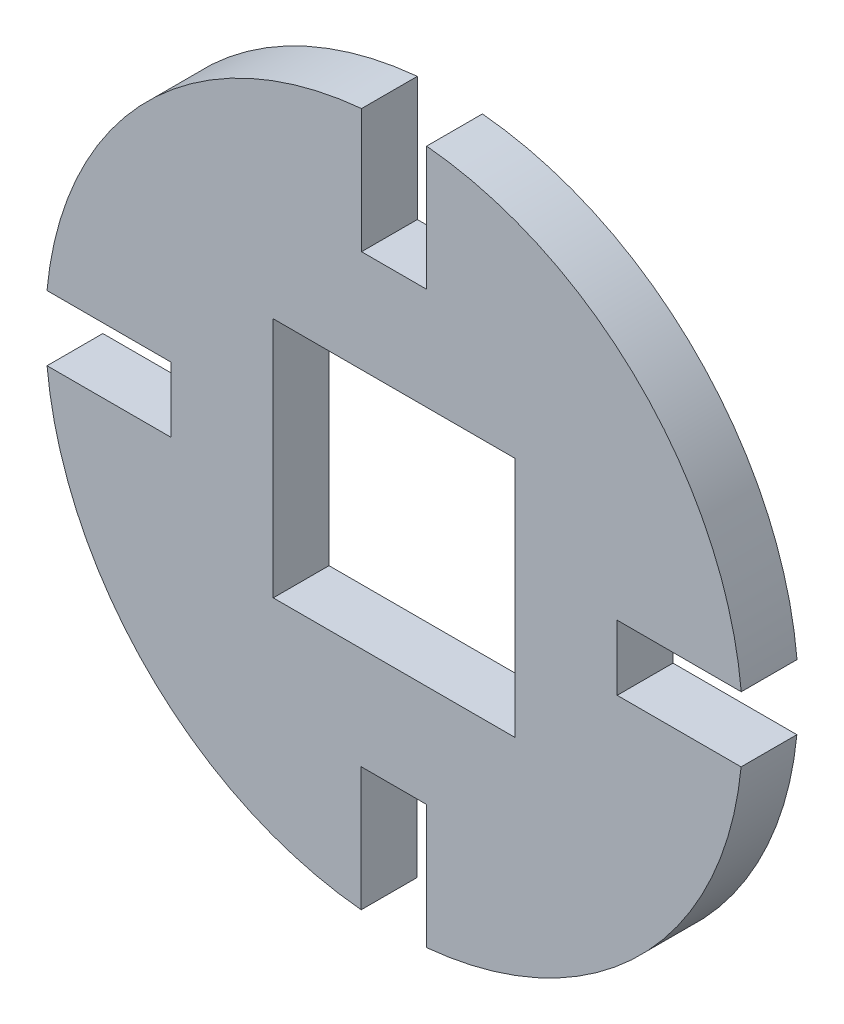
ISO-10303-21;
HEADER;
FILE_DESCRIPTION(('STEP AP214'),'2;1');
FILE_NAME('part.step','',(''),(''),'','','');
FILE_SCHEMA(('AUTOMOTIVE_DESIGN { 1 0 10303 214 1 1 1 1 }'));
ENDSEC;
DATA;
#1=APPLICATION_CONTEXT('core data for automotive mechanical design processes');
#2=APPLICATION_PROTOCOL_DEFINITION('international standard','automotive_design',2000,#1);
#3=PRODUCT_CONTEXT('',#1,'mechanical');
#4=PRODUCT('Part','Part','',(#3));
#5=PRODUCT_RELATED_PRODUCT_CATEGORY('part','',(#4));
#6=PRODUCT_DEFINITION_FORMATION('','',#4);
#7=PRODUCT_DEFINITION_CONTEXT('part definition',#1,'design');
#8=PRODUCT_DEFINITION('design','',#6,#7);
#9=PRODUCT_DEFINITION_SHAPE('','',#8);
#10=(LENGTH_UNIT() NAMED_UNIT(*) SI_UNIT(.MILLI.,.METRE.));
#11=(NAMED_UNIT(*) PLANE_ANGLE_UNIT() SI_UNIT($,.RADIAN.));
#12=(NAMED_UNIT(*) SI_UNIT($,.STERADIAN.) SOLID_ANGLE_UNIT());
#13=UNCERTAINTY_MEASURE_WITH_UNIT(LENGTH_MEASURE(1.E-05),#10,'distance_accuracy_value','');
#14=(GEOMETRIC_REPRESENTATION_CONTEXT(3) GLOBAL_UNCERTAINTY_ASSIGNED_CONTEXT((#13)) GLOBAL_UNIT_ASSIGNED_CONTEXT((#10,
#11,#12)) REPRESENTATION_CONTEXT('',''));
#15=CARTESIAN_POINT('',(0.,0.,0.));
#16=DIRECTION('',(0.,0.,1.));
#17=DIRECTION('',(1.,0.,0.));
#18=AXIS2_PLACEMENT_3D('',#15,#16,#17);
#19=CARTESIAN_POINT('',(0.,0.,3.));
#20=DIRECTION('',(0.,0.,1.));
#21=DIRECTION('',(1.,0.,0.));
#22=AXIS2_PLACEMENT_3D('',#19,#20,#21);
#23=PLANE('',#22);
#24=CARTESIAN_POINT('',(0.,0.,3.));
#25=DIRECTION('',(0.,0.,1.));
#26=DIRECTION('',(1.,0.,0.));
#27=AXIS2_PLACEMENT_3D('',#24,#25,#26);
#28=CIRCLE('',#27,18.75);
#29=CARTESIAN_POINT('',(1.73020230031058,-18.67,3.));
#30=VERTEX_POINT('',#29);
#31=CARTESIAN_POINT('',(18.6643739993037,-1.78987240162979,3.));
#32=VERTEX_POINT('',#31);
#33=EDGE_CURVE('E229',#30,#32,#28,.T.);
#34=ORIENTED_EDGE('',*,*,#33,.T.);
#35=DIRECTION('',(-1.,0.,0.));
#36=VECTOR('',#35,1.);
#37=CARTESIAN_POINT('',(12.,-1.78987240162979,3.));
#38=LINE('',#37,#36);
#39=CARTESIAN_POINT('',(12.,-1.78987240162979,3.));
#40=VERTEX_POINT('',#39);
#41=EDGE_CURVE('E233',#32,#40,#38,.T.);
#42=ORIENTED_EDGE('',*,*,#41,.T.);
#43=DIRECTION('',(0.,1.,0.));
#44=VECTOR('',#43,1.);
#45=CARTESIAN_POINT('',(12.,-1.78987240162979,3.));
#46=LINE('',#45,#44);
#47=CARTESIAN_POINT('',(12.,1.71012759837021,3.));
#48=VERTEX_POINT('',#47);
#49=EDGE_CURVE('E237',#40,#48,#46,.T.);
#50=ORIENTED_EDGE('',*,*,#49,.T.);
#51=DIRECTION('',(1.,0.,0.));
#52=VECTOR('',#51,1.);
#53=CARTESIAN_POINT('',(12.,1.71012759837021,3.));
#54=LINE('',#53,#52);
#55=CARTESIAN_POINT('',(18.6718494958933,1.71012759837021,3.));
#56=VERTEX_POINT('',#55);
#57=EDGE_CURVE('E240',#48,#56,#54,.T.);
#58=ORIENTED_EDGE('',*,*,#57,.T.);
#59=CARTESIAN_POINT('',(0.,0.,3.));
#60=DIRECTION('',(0.,0.,1.));
#61=DIRECTION('',(1.,0.,0.));
#62=AXIS2_PLACEMENT_3D('',#59,#60,#61);
#63=CIRCLE('',#62,18.75);
#64=CARTESIAN_POINT('',(1.75,18.6681547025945,3.));
#65=VERTEX_POINT('',#64);
#66=EDGE_CURVE('E243',#56,#65,#63,.T.);
#67=ORIENTED_EDGE('',*,*,#66,.T.);
#68=DIRECTION('',(0.,-1.,0.));
#69=VECTOR('',#68,1.);
#70=CARTESIAN_POINT('',(1.75,11.9981547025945,3.));
#71=LINE('',#70,#69);
#72=CARTESIAN_POINT('',(1.75,11.9981547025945,3.));
#73=VERTEX_POINT('',#72);
#74=EDGE_CURVE('E246',#65,#73,#71,.T.);
#75=ORIENTED_EDGE('',*,*,#74,.T.);
#76=DIRECTION('',(-1.,0.,0.));
#77=VECTOR('',#76,1.);
#78=CARTESIAN_POINT('',(-1.75,11.9981547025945,3.));
#79=LINE('',#78,#77);
#80=CARTESIAN_POINT('',(-1.75,11.9981547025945,3.));
#81=VERTEX_POINT('',#80);
#82=EDGE_CURVE('E249',#73,#81,#79,.T.);
#83=ORIENTED_EDGE('',*,*,#82,.T.);
#84=DIRECTION('',(0.,1.,0.));
#85=VECTOR('',#84,1.);
#86=CARTESIAN_POINT('',(-1.75,11.9981547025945,3.));
#87=LINE('',#86,#85);
#88=CARTESIAN_POINT('',(-1.75,18.6681547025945,3.));
#89=VERTEX_POINT('',#88);
#90=EDGE_CURVE('E252',#81,#89,#87,.T.);
#91=ORIENTED_EDGE('',*,*,#90,.T.);
#92=CARTESIAN_POINT('',(0.,0.,3.));
#93=DIRECTION('',(0.,0.,1.));
#94=DIRECTION('',(1.,0.,0.));
#95=AXIS2_PLACEMENT_3D('',#92,#93,#94);
#96=CIRCLE('',#95,18.75);
#97=CARTESIAN_POINT('',(-18.67,1.73020230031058,3.));
#98=VERTEX_POINT('',#97);
#99=EDGE_CURVE('E255',#89,#98,#96,.T.);
#100=ORIENTED_EDGE('',*,*,#99,.T.);
#101=DIRECTION('',(1.,0.,0.));
#102=VECTOR('',#101,1.);
#103=CARTESIAN_POINT('',(-12.,1.73020230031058,3.));
#104=LINE('',#103,#102);
#105=CARTESIAN_POINT('',(-12.,1.73020230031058,3.));
#106=VERTEX_POINT('',#105);
#107=EDGE_CURVE('E258',#98,#106,#104,.T.);
#108=ORIENTED_EDGE('',*,*,#107,.T.);
#109=DIRECTION('',(0.,-1.,0.));
#110=VECTOR('',#109,1.);
#111=CARTESIAN_POINT('',(-12.,-1.76979769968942,3.));
#112=LINE('',#111,#110);
#113=CARTESIAN_POINT('',(-12.,-1.76979769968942,3.));
#114=VERTEX_POINT('',#113);
#115=EDGE_CURVE('E261',#106,#114,#112,.T.);
#116=ORIENTED_EDGE('',*,*,#115,.T.);
#117=DIRECTION('',(-1.,0.,0.));
#118=VECTOR('',#117,1.);
#119=CARTESIAN_POINT('',(-12.,-1.76979769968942,3.));
#120=LINE('',#119,#118);
#121=CARTESIAN_POINT('',(-18.6662882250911,-1.76979769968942,3.));
#122=VERTEX_POINT('',#121);
#123=EDGE_CURVE('E264',#114,#122,#120,.T.);
#124=ORIENTED_EDGE('',*,*,#123,.T.);
#125=CARTESIAN_POINT('',(0.,0.,3.));
#126=DIRECTION('',(0.,0.,1.));
#127=DIRECTION('',(1.,0.,0.));
#128=AXIS2_PLACEMENT_3D('',#125,#126,#127);
#129=CIRCLE('',#128,18.75);
#130=CARTESIAN_POINT('',(-1.76979769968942,-18.6662882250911,3.));
#131=VERTEX_POINT('',#130);
#132=EDGE_CURVE('E267',#122,#131,#129,.T.);
#133=ORIENTED_EDGE('',*,*,#132,.T.);
#134=DIRECTION('',(0.,1.,0.));
#135=VECTOR('',#134,1.);
#136=CARTESIAN_POINT('',(-1.76979769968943,-12.,3.));
#137=LINE('',#136,#135);
#138=CARTESIAN_POINT('',(-1.76979769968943,-12.,3.));
#139=VERTEX_POINT('',#138);
#140=EDGE_CURVE('E270',#131,#139,#137,.T.);
#141=ORIENTED_EDGE('',*,*,#140,.T.);
#142=DIRECTION('',(1.,0.,0.));
#143=VECTOR('',#142,1.);
#144=CARTESIAN_POINT('',(-1.76979769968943,-12.,3.));
#145=LINE('',#144,#143);
#146=CARTESIAN_POINT('',(1.73020230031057,-12.,3.));
#147=VERTEX_POINT('',#146);
#148=EDGE_CURVE('E273',#139,#147,#145,.T.);
#149=ORIENTED_EDGE('',*,*,#148,.T.);
#150=DIRECTION('',(0.,-1.,0.));
#151=VECTOR('',#150,1.);
#152=CARTESIAN_POINT('',(1.73020230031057,-12.,3.));
#153=LINE('',#152,#151);
#154=EDGE_CURVE('E276',#147,#30,#153,.T.);
#155=ORIENTED_EDGE('',*,*,#154,.T.);
#156=EDGE_LOOP('',(#34,#42,#50,#58,#67,#75,#83,#91,#100,#108,#116,#124,#133,#141,#149,#155));
#157=FACE_BOUND('',#156,.T.);
#158=DIRECTION('',(-1.,0.,0.));
#159=VECTOR('',#158,1.);
#160=CARTESIAN_POINT('',(-6.5,6.5,3.));
#161=LINE('',#160,#159);
#162=CARTESIAN_POINT('',(6.5,6.5,3.));
#163=VERTEX_POINT('',#162);
#164=CARTESIAN_POINT('',(-6.5,6.5,3.));
#165=VERTEX_POINT('',#164);
#166=EDGE_CURVE('E190',#163,#165,#161,.T.);
#167=ORIENTED_EDGE('',*,*,#166,.F.);
#168=DIRECTION('',(0.,1.,0.));
#169=VECTOR('',#168,1.);
#170=CARTESIAN_POINT('',(6.5,-6.5,3.));
#171=LINE('',#170,#169);
#172=CARTESIAN_POINT('',(6.5,-6.5,3.));
#173=VERTEX_POINT('',#172);
#174=EDGE_CURVE('E181',#173,#163,#171,.T.);
#175=ORIENTED_EDGE('',*,*,#174,.F.);
#176=DIRECTION('',(1.,0.,0.));
#177=VECTOR('',#176,1.);
#178=CARTESIAN_POINT('',(-6.5,-6.5,3.));
#179=LINE('',#178,#177);
#180=CARTESIAN_POINT('',(-6.5,-6.5,3.));
#181=VERTEX_POINT('',#180);
#182=EDGE_CURVE('E207',#181,#173,#179,.T.);
#183=ORIENTED_EDGE('',*,*,#182,.F.);
#184=DIRECTION('',(0.,-1.,0.));
#185=VECTOR('',#184,1.);
#186=CARTESIAN_POINT('',(-6.5,-6.5,3.));
#187=LINE('',#186,#185);
#188=EDGE_CURVE('E203',#165,#181,#187,.T.);
#189=ORIENTED_EDGE('',*,*,#188,.F.);
#190=EDGE_LOOP('',(#167,#175,#183,#189));
#191=FACE_BOUND('',#190,.T.);
#192=ADVANCED_FACE('F43',(#157,#191),#23,.T.);
#193=CARTESIAN_POINT('',(0.,0.,0.));
#194=DIRECTION('',(0.,0.,1.));
#195=DIRECTION('',(1.,0.,0.));
#196=AXIS2_PLACEMENT_3D('',#193,#194,#195);
#197=PLANE('',#196);
#198=CARTESIAN_POINT('',(0.,0.,0.));
#199=DIRECTION('',(0.,0.,1.));
#200=DIRECTION('',(1.,0.,0.));
#201=AXIS2_PLACEMENT_3D('',#198,#199,#200);
#202=CIRCLE('',#201,18.75);
#203=CARTESIAN_POINT('',(1.73020230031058,-18.67,0.));
#204=VERTEX_POINT('',#203);
#205=CARTESIAN_POINT('',(18.6643739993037,-1.78987240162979,0.));
#206=VERTEX_POINT('',#205);
#207=EDGE_CURVE('E199',#204,#206,#202,.T.);
#208=ORIENTED_EDGE('',*,*,#207,.F.);
#209=DIRECTION('',(0.,-1.,0.));
#210=VECTOR('',#209,1.);
#211=CARTESIAN_POINT('',(1.73020230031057,-12.,0.));
#212=LINE('',#211,#210);
#213=CARTESIAN_POINT('',(1.73020230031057,-12.,0.));
#214=VERTEX_POINT('',#213);
#215=EDGE_CURVE('E234',#214,#204,#212,.T.);
#216=ORIENTED_EDGE('',*,*,#215,.F.);
#217=DIRECTION('',(1.,0.,0.));
#218=VECTOR('',#217,1.);
#219=CARTESIAN_POINT('',(-1.76979769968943,-12.,0.));
#220=LINE('',#219,#218);
#221=CARTESIAN_POINT('',(-1.76979769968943,-12.,0.));
#222=VERTEX_POINT('',#221);
#223=EDGE_CURVE('E322',#222,#214,#220,.T.);
#224=ORIENTED_EDGE('',*,*,#223,.F.);
#225=DIRECTION('',(0.,1.,0.));
#226=VECTOR('',#225,1.);
#227=CARTESIAN_POINT('',(-1.76979769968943,-12.,0.));
#228=LINE('',#227,#226);
#229=CARTESIAN_POINT('',(-1.76979769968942,-18.6662882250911,0.));
#230=VERTEX_POINT('',#229);
#231=EDGE_CURVE('E319',#230,#222,#228,.T.);
#232=ORIENTED_EDGE('',*,*,#231,.F.);
#233=CARTESIAN_POINT('',(0.,0.,0.));
#234=DIRECTION('',(0.,0.,1.));
#235=DIRECTION('',(1.,0.,0.));
#236=AXIS2_PLACEMENT_3D('',#233,#234,#235);
#237=CIRCLE('',#236,18.75);
#238=CARTESIAN_POINT('',(-18.6662882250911,-1.76979769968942,0.));
#239=VERTEX_POINT('',#238);
#240=EDGE_CURVE('E316',#239,#230,#237,.T.);
#241=ORIENTED_EDGE('',*,*,#240,.F.);
#242=DIRECTION('',(-1.,0.,0.));
#243=VECTOR('',#242,1.);
#244=CARTESIAN_POINT('',(-12.,-1.76979769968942,0.));
#245=LINE('',#244,#243);
#246=CARTESIAN_POINT('',(-12.,-1.76979769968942,0.));
#247=VERTEX_POINT('',#246);
#248=EDGE_CURVE('E313',#247,#239,#245,.T.);
#249=ORIENTED_EDGE('',*,*,#248,.F.);
#250=DIRECTION('',(0.,-1.,0.));
#251=VECTOR('',#250,1.);
#252=CARTESIAN_POINT('',(-12.,-1.76979769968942,0.));
#253=LINE('',#252,#251);
#254=CARTESIAN_POINT('',(-12.,1.73020230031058,0.));
#255=VERTEX_POINT('',#254);
#256=EDGE_CURVE('E310',#255,#247,#253,.T.);
#257=ORIENTED_EDGE('',*,*,#256,.F.);
#258=DIRECTION('',(1.,0.,0.));
#259=VECTOR('',#258,1.);
#260=CARTESIAN_POINT('',(-12.,1.73020230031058,0.));
#261=LINE('',#260,#259);
#262=CARTESIAN_POINT('',(-18.67,1.73020230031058,0.));
#263=VERTEX_POINT('',#262);
#264=EDGE_CURVE('E307',#263,#255,#261,.T.);
#265=ORIENTED_EDGE('',*,*,#264,.F.);
#266=CARTESIAN_POINT('',(0.,0.,0.));
#267=DIRECTION('',(0.,0.,1.));
#268=DIRECTION('',(1.,0.,0.));
#269=AXIS2_PLACEMENT_3D('',#266,#267,#268);
#270=CIRCLE('',#269,18.75);
#271=CARTESIAN_POINT('',(-1.75,18.6681547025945,0.));
#272=VERTEX_POINT('',#271);
#273=EDGE_CURVE('E304',#272,#263,#270,.T.);
#274=ORIENTED_EDGE('',*,*,#273,.F.);
#275=DIRECTION('',(0.,1.,0.));
#276=VECTOR('',#275,1.);
#277=CARTESIAN_POINT('',(-1.75,11.9981547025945,0.));
#278=LINE('',#277,#276);
#279=CARTESIAN_POINT('',(-1.75,11.9981547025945,0.));
#280=VERTEX_POINT('',#279);
#281=EDGE_CURVE('E301',#280,#272,#278,.T.);
#282=ORIENTED_EDGE('',*,*,#281,.F.);
#283=DIRECTION('',(-1.,0.,0.));
#284=VECTOR('',#283,1.);
#285=CARTESIAN_POINT('',(-1.75,11.9981547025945,0.));
#286=LINE('',#285,#284);
#287=CARTESIAN_POINT('',(1.75,11.9981547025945,0.));
#288=VERTEX_POINT('',#287);
#289=EDGE_CURVE('E298',#288,#280,#286,.T.);
#290=ORIENTED_EDGE('',*,*,#289,.F.);
#291=DIRECTION('',(0.,-1.,0.));
#292=VECTOR('',#291,1.);
#293=CARTESIAN_POINT('',(1.75,11.9981547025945,0.));
#294=LINE('',#293,#292);
#295=CARTESIAN_POINT('',(1.75,18.6681547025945,0.));
#296=VERTEX_POINT('',#295);
#297=EDGE_CURVE('E295',#296,#288,#294,.T.);
#298=ORIENTED_EDGE('',*,*,#297,.F.);
#299=CARTESIAN_POINT('',(0.,0.,0.));
#300=DIRECTION('',(0.,0.,1.));
#301=DIRECTION('',(1.,0.,0.));
#302=AXIS2_PLACEMENT_3D('',#299,#300,#301);
#303=CIRCLE('',#302,18.75);
#304=CARTESIAN_POINT('',(18.6718494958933,1.71012759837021,0.));
#305=VERTEX_POINT('',#304);
#306=EDGE_CURVE('E292',#305,#296,#303,.T.);
#307=ORIENTED_EDGE('',*,*,#306,.F.);
#308=DIRECTION('',(1.,0.,0.));
#309=VECTOR('',#308,1.);
#310=CARTESIAN_POINT('',(12.,1.71012759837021,0.));
#311=LINE('',#310,#309);
#312=CARTESIAN_POINT('',(12.,1.71012759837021,0.));
#313=VERTEX_POINT('',#312);
#314=EDGE_CURVE('E289',#313,#305,#311,.T.);
#315=ORIENTED_EDGE('',*,*,#314,.F.);
#316=DIRECTION('',(0.,1.,0.));
#317=VECTOR('',#316,1.);
#318=CARTESIAN_POINT('',(12.,-1.78987240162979,0.));
#319=LINE('',#318,#317);
#320=CARTESIAN_POINT('',(12.,-1.78987240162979,0.));
#321=VERTEX_POINT('',#320);
#322=EDGE_CURVE('E286',#321,#313,#319,.T.);
#323=ORIENTED_EDGE('',*,*,#322,.F.);
#324=DIRECTION('',(-1.,0.,0.));
#325=VECTOR('',#324,1.);
#326=CARTESIAN_POINT('',(12.,-1.78987240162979,0.));
#327=LINE('',#326,#325);
#328=EDGE_CURVE('E283',#206,#321,#327,.T.);
#329=ORIENTED_EDGE('',*,*,#328,.F.);
#330=EDGE_LOOP('',(#208,#216,#224,#232,#241,#249,#257,#265,#274,#282,#290,#298,#307,#315,#323,#329));
#331=FACE_BOUND('',#330,.T.);
#332=DIRECTION('',(0.,1.,0.));
#333=VECTOR('',#332,1.);
#334=CARTESIAN_POINT('',(6.5,-6.5,0.));
#335=LINE('',#334,#333);
#336=CARTESIAN_POINT('',(6.5,-6.5,0.));
#337=VERTEX_POINT('',#336);
#338=CARTESIAN_POINT('',(6.5,6.5,0.));
#339=VERTEX_POINT('',#338);
#340=EDGE_CURVE('E67',#337,#339,#335,.T.);
#341=ORIENTED_EDGE('',*,*,#340,.T.);
#342=DIRECTION('',(-1.,0.,0.));
#343=VECTOR('',#342,1.);
#344=CARTESIAN_POINT('',(-6.5,6.5,0.));
#345=LINE('',#344,#343);
#346=CARTESIAN_POINT('',(-6.5,6.5,0.));
#347=VERTEX_POINT('',#346);
#348=EDGE_CURVE('E197',#339,#347,#345,.T.);
#349=ORIENTED_EDGE('',*,*,#348,.T.);
#350=DIRECTION('',(0.,-1.,0.));
#351=VECTOR('',#350,1.);
#352=CARTESIAN_POINT('',(-6.5,-6.5,0.));
#353=LINE('',#352,#351);
#354=CARTESIAN_POINT('',(-6.5,-6.5,0.));
#355=VERTEX_POINT('',#354);
#356=EDGE_CURVE('E216',#347,#355,#353,.T.);
#357=ORIENTED_EDGE('',*,*,#356,.T.);
#358=DIRECTION('',(1.,0.,0.));
#359=VECTOR('',#358,1.);
#360=CARTESIAN_POINT('',(-6.5,-6.5,0.));
#361=LINE('',#360,#359);
#362=EDGE_CURVE('E191',#355,#337,#361,.T.);
#363=ORIENTED_EDGE('',*,*,#362,.T.);
#364=EDGE_LOOP('',(#341,#349,#357,#363));
#365=FACE_BOUND('',#364,.T.);
#366=ADVANCED_FACE('F393',(#331,#365),#197,.F.);
#367=CARTESIAN_POINT('',(0.,0.,3.));
#368=DIRECTION('',(0.,0.,-1.));
#369=DIRECTION('',(-1.,0.,0.));
#370=AXIS2_PLACEMENT_3D('',#367,#368,#369);
#371=CYLINDRICAL_SURFACE('',#370,18.75);
#372=ORIENTED_EDGE('',*,*,#207,.T.);
#373=DIRECTION('',(0.,0.,-1.));
#374=VECTOR('',#373,1.);
#375=CARTESIAN_POINT('',(18.6643739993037,-1.78987240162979,3.));
#376=LINE('',#375,#374);
#377=EDGE_CURVE('E11',#32,#206,#376,.T.);
#378=ORIENTED_EDGE('',*,*,#377,.F.);
#379=ORIENTED_EDGE('',*,*,#33,.F.);
#380=DIRECTION('',(0.,0.,-1.));
#381=VECTOR('',#380,1.);
#382=CARTESIAN_POINT('',(1.73020230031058,-18.67,3.));
#383=LINE('',#382,#381);
#384=EDGE_CURVE('E279',#30,#204,#383,.T.);
#385=ORIENTED_EDGE('',*,*,#384,.T.);
#386=EDGE_LOOP('',(#372,#378,#379,#385));
#387=FACE_BOUND('',#386,.T.);
#388=ADVANCED_FACE('F45',(#387),#371,.T.);
#389=CARTESIAN_POINT('',(12.,-1.78987240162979,3.));
#390=DIRECTION('',(0.,-1.,0.));
#391=DIRECTION('',(0.,0.,-1.));
#392=AXIS2_PLACEMENT_3D('',#389,#390,#391);
#393=PLANE('',#392);
#394=ORIENTED_EDGE('',*,*,#328,.T.);
#395=DIRECTION('',(0.,0.,-1.));
#396=VECTOR('',#395,1.);
#397=CARTESIAN_POINT('',(12.,-1.78987240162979,3.));
#398=LINE('',#397,#396);
#399=EDGE_CURVE('E52',#40,#321,#398,.T.);
#400=ORIENTED_EDGE('',*,*,#399,.F.);
#401=ORIENTED_EDGE('',*,*,#41,.F.);
#402=ORIENTED_EDGE('',*,*,#377,.T.);
#403=EDGE_LOOP('',(#394,#400,#401,#402));
#404=FACE_BOUND('',#403,.T.);
#405=ADVANCED_FACE('F410',(#404),#393,.F.);
#406=CARTESIAN_POINT('',(12.,-1.78987240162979,3.));
#407=DIRECTION('',(-1.,0.,0.));
#408=DIRECTION('',(0.,0.,1.));
#409=AXIS2_PLACEMENT_3D('',#406,#407,#408);
#410=PLANE('',#409);
#411=ORIENTED_EDGE('',*,*,#322,.T.);
#412=DIRECTION('',(0.,0.,-1.));
#413=VECTOR('',#412,1.);
#414=CARTESIAN_POINT('',(12.,1.71012759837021,3.));
#415=LINE('',#414,#413);
#416=EDGE_CURVE('E378',#48,#313,#415,.T.);
#417=ORIENTED_EDGE('',*,*,#416,.F.);
#418=ORIENTED_EDGE('',*,*,#49,.F.);
#419=ORIENTED_EDGE('',*,*,#399,.T.);
#420=EDGE_LOOP('',(#411,#417,#418,#419));
#421=FACE_BOUND('',#420,.T.);
#422=ADVANCED_FACE('F387',(#421),#410,.F.);
#423=CARTESIAN_POINT('',(12.,1.71012759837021,3.));
#424=DIRECTION('',(0.,1.,0.));
#425=DIRECTION('',(0.,0.,1.));
#426=AXIS2_PLACEMENT_3D('',#423,#424,#425);
#427=PLANE('',#426);
#428=ORIENTED_EDGE('',*,*,#314,.T.);
#429=DIRECTION('',(0.,0.,-1.));
#430=VECTOR('',#429,1.);
#431=CARTESIAN_POINT('',(18.6718494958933,1.71012759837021,3.));
#432=LINE('',#431,#430);
#433=EDGE_CURVE('E374',#56,#305,#432,.T.);
#434=ORIENTED_EDGE('',*,*,#433,.F.);
#435=ORIENTED_EDGE('',*,*,#57,.F.);
#436=ORIENTED_EDGE('',*,*,#416,.T.);
#437=EDGE_LOOP('',(#428,#434,#435,#436));
#438=FACE_BOUND('',#437,.T.);
#439=ADVANCED_FACE('F399',(#438),#427,.F.);
#440=CARTESIAN_POINT('',(0.,0.,3.));
#441=DIRECTION('',(0.,0.,-1.));
#442=DIRECTION('',(-1.,0.,0.));
#443=AXIS2_PLACEMENT_3D('',#440,#441,#442);
#444=CYLINDRICAL_SURFACE('',#443,18.75);
#445=ORIENTED_EDGE('',*,*,#306,.T.);
#446=DIRECTION('',(0.,0.,-1.));
#447=VECTOR('',#446,1.);
#448=CARTESIAN_POINT('',(1.75,18.6681547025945,3.));
#449=LINE('',#448,#447);
#450=EDGE_CURVE('E370',#65,#296,#449,.T.);
#451=ORIENTED_EDGE('',*,*,#450,.F.);
#452=ORIENTED_EDGE('',*,*,#66,.F.);
#453=ORIENTED_EDGE('',*,*,#433,.T.);
#454=EDGE_LOOP('',(#445,#451,#452,#453));
#455=FACE_BOUND('',#454,.T.);
#456=ADVANCED_FACE('F403',(#455),#444,.T.);
#457=CARTESIAN_POINT('',(1.75,11.9981547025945,3.));
#458=DIRECTION('',(1.,0.,0.));
#459=DIRECTION('',(0.,1.,0.));
#460=AXIS2_PLACEMENT_3D('',#457,#458,#459);
#461=PLANE('',#460);
#462=ORIENTED_EDGE('',*,*,#297,.T.);
#463=DIRECTION('',(0.,0.,-1.));
#464=VECTOR('',#463,1.);
#465=CARTESIAN_POINT('',(1.75,11.9981547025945,3.));
#466=LINE('',#465,#464);
#467=EDGE_CURVE('E366',#73,#288,#466,.T.);
#468=ORIENTED_EDGE('',*,*,#467,.F.);
#469=ORIENTED_EDGE('',*,*,#74,.F.);
#470=ORIENTED_EDGE('',*,*,#450,.T.);
#471=EDGE_LOOP('',(#462,#468,#469,#470));
#472=FACE_BOUND('',#471,.T.);
#473=ADVANCED_FACE('F463',(#472),#461,.F.);
#474=CARTESIAN_POINT('',(-1.75,11.9981547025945,3.));
#475=DIRECTION('',(0.,-1.,0.));
#476=DIRECTION('',(0.,0.,-1.));
#477=AXIS2_PLACEMENT_3D('',#474,#475,#476);
#478=PLANE('',#477);
#479=ORIENTED_EDGE('',*,*,#289,.T.);
#480=DIRECTION('',(0.,0.,-1.));
#481=VECTOR('',#480,1.);
#482=CARTESIAN_POINT('',(-1.75,11.9981547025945,3.));
#483=LINE('',#482,#481);
#484=EDGE_CURVE('E362',#81,#280,#483,.T.);
#485=ORIENTED_EDGE('',*,*,#484,.F.);
#486=ORIENTED_EDGE('',*,*,#82,.F.);
#487=ORIENTED_EDGE('',*,*,#467,.T.);
#488=EDGE_LOOP('',(#479,#485,#486,#487));
#489=FACE_BOUND('',#488,.T.);
#490=ADVANCED_FACE('F460',(#489),#478,.F.);
#491=CARTESIAN_POINT('',(-1.75,11.9981547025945,3.));
#492=DIRECTION('',(-1.,0.,0.));
#493=DIRECTION('',(0.,0.,1.));
#494=AXIS2_PLACEMENT_3D('',#491,#492,#493);
#495=PLANE('',#494);
#496=ORIENTED_EDGE('',*,*,#281,.T.);
#497=DIRECTION('',(0.,0.,-1.));
#498=VECTOR('',#497,1.);
#499=CARTESIAN_POINT('',(-1.75,18.6681547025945,3.));
#500=LINE('',#499,#498);
#501=EDGE_CURVE('E358',#89,#272,#500,.T.);
#502=ORIENTED_EDGE('',*,*,#501,.F.);
#503=ORIENTED_EDGE('',*,*,#90,.F.);
#504=ORIENTED_EDGE('',*,*,#484,.T.);
#505=EDGE_LOOP('',(#496,#502,#503,#504));
#506=FACE_BOUND('',#505,.T.);
#507=ADVANCED_FACE('F456',(#506),#495,.F.);
#508=CARTESIAN_POINT('',(0.,0.,3.));
#509=DIRECTION('',(0.,0.,-1.));
#510=DIRECTION('',(-1.,0.,0.));
#511=AXIS2_PLACEMENT_3D('',#508,#509,#510);
#512=CYLINDRICAL_SURFACE('',#511,18.75);
#513=ORIENTED_EDGE('',*,*,#273,.T.);
#514=DIRECTION('',(0.,0.,-1.));
#515=VECTOR('',#514,1.);
#516=CARTESIAN_POINT('',(-18.67,1.73020230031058,3.));
#517=LINE('',#516,#515);
#518=EDGE_CURVE('E354',#98,#263,#517,.T.);
#519=ORIENTED_EDGE('',*,*,#518,.F.);
#520=ORIENTED_EDGE('',*,*,#99,.F.);
#521=ORIENTED_EDGE('',*,*,#501,.T.);
#522=EDGE_LOOP('',(#513,#519,#520,#521));
#523=FACE_BOUND('',#522,.T.);
#524=ADVANCED_FACE('F452',(#523),#512,.T.);
#525=CARTESIAN_POINT('',(-12.,1.73020230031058,3.));
#526=DIRECTION('',(0.,1.,0.));
#527=DIRECTION('',(-1.,0.,0.));
#528=AXIS2_PLACEMENT_3D('',#525,#526,#527);
#529=PLANE('',#528);
#530=ORIENTED_EDGE('',*,*,#264,.T.);
#531=DIRECTION('',(0.,0.,-1.));
#532=VECTOR('',#531,1.);
#533=CARTESIAN_POINT('',(-12.,1.73020230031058,3.));
#534=LINE('',#533,#532);
#535=EDGE_CURVE('E350',#106,#255,#534,.T.);
#536=ORIENTED_EDGE('',*,*,#535,.F.);
#537=ORIENTED_EDGE('',*,*,#107,.F.);
#538=ORIENTED_EDGE('',*,*,#518,.T.);
#539=EDGE_LOOP('',(#530,#536,#537,#538));
#540=FACE_BOUND('',#539,.T.);
#541=ADVANCED_FACE('F447',(#540),#529,.F.);
#542=CARTESIAN_POINT('',(-12.,-1.76979769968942,3.));
#543=DIRECTION('',(1.,0.,0.));
#544=DIRECTION('',(0.,0.,-1.));
#545=AXIS2_PLACEMENT_3D('',#542,#543,#544);
#546=PLANE('',#545);
#547=ORIENTED_EDGE('',*,*,#256,.T.);
#548=DIRECTION('',(0.,0.,-1.));
#549=VECTOR('',#548,1.);
#550=CARTESIAN_POINT('',(-12.,-1.76979769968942,3.));
#551=LINE('',#550,#549);
#552=EDGE_CURVE('E346',#114,#247,#551,.T.);
#553=ORIENTED_EDGE('',*,*,#552,.F.);
#554=ORIENTED_EDGE('',*,*,#115,.F.);
#555=ORIENTED_EDGE('',*,*,#535,.T.);
#556=EDGE_LOOP('',(#547,#553,#554,#555));
#557=FACE_BOUND('',#556,.T.);
#558=ADVANCED_FACE('F441',(#557),#546,.F.);
#559=CARTESIAN_POINT('',(-12.,-1.76979769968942,3.));
#560=DIRECTION('',(0.,-1.,0.));
#561=DIRECTION('',(1.,0.,0.));
#562=AXIS2_PLACEMENT_3D('',#559,#560,#561);
#563=PLANE('',#562);
#564=ORIENTED_EDGE('',*,*,#248,.T.);
#565=DIRECTION('',(0.,0.,-1.));
#566=VECTOR('',#565,1.);
#567=CARTESIAN_POINT('',(-18.6662882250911,-1.76979769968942,3.));
#568=LINE('',#567,#566);
#569=EDGE_CURVE('E342',#122,#239,#568,.T.);
#570=ORIENTED_EDGE('',*,*,#569,.F.);
#571=ORIENTED_EDGE('',*,*,#123,.F.);
#572=ORIENTED_EDGE('',*,*,#552,.T.);
#573=EDGE_LOOP('',(#564,#570,#571,#572));
#574=FACE_BOUND('',#573,.T.);
#575=ADVANCED_FACE('F437',(#574),#563,.F.);
#576=CARTESIAN_POINT('',(0.,0.,3.));
#577=DIRECTION('',(0.,0.,-1.));
#578=DIRECTION('',(-1.,0.,0.));
#579=AXIS2_PLACEMENT_3D('',#576,#577,#578);
#580=CYLINDRICAL_SURFACE('',#579,18.75);
#581=ORIENTED_EDGE('',*,*,#240,.T.);
#582=DIRECTION('',(0.,0.,-1.));
#583=VECTOR('',#582,1.);
#584=CARTESIAN_POINT('',(-1.76979769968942,-18.6662882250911,3.));
#585=LINE('',#584,#583);
#586=EDGE_CURVE('E338',#131,#230,#585,.T.);
#587=ORIENTED_EDGE('',*,*,#586,.F.);
#588=ORIENTED_EDGE('',*,*,#132,.F.);
#589=ORIENTED_EDGE('',*,*,#569,.T.);
#590=EDGE_LOOP('',(#581,#587,#588,#589));
#591=FACE_BOUND('',#590,.T.);
#592=ADVANCED_FACE('F432',(#591),#580,.T.);
#593=CARTESIAN_POINT('',(-1.76979769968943,-12.,3.));
#594=DIRECTION('',(-1.,0.,0.));
#595=DIRECTION('',(0.,-1.,0.));
#596=AXIS2_PLACEMENT_3D('',#593,#594,#595);
#597=PLANE('',#596);
#598=ORIENTED_EDGE('',*,*,#231,.T.);
#599=DIRECTION('',(0.,0.,-1.));
#600=VECTOR('',#599,1.);
#601=CARTESIAN_POINT('',(-1.76979769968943,-12.,3.));
#602=LINE('',#601,#600);
#603=EDGE_CURVE('E334',#139,#222,#602,.T.);
#604=ORIENTED_EDGE('',*,*,#603,.F.);
#605=ORIENTED_EDGE('',*,*,#140,.F.);
#606=ORIENTED_EDGE('',*,*,#586,.T.);
#607=EDGE_LOOP('',(#598,#604,#605,#606));
#608=FACE_BOUND('',#607,.T.);
#609=ADVANCED_FACE('F426',(#608),#597,.F.);
#610=CARTESIAN_POINT('',(-1.76979769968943,-12.,3.));
#611=DIRECTION('',(0.,1.,0.));
#612=DIRECTION('',(-1.,0.,0.));
#613=AXIS2_PLACEMENT_3D('',#610,#611,#612);
#614=PLANE('',#613);
#615=ORIENTED_EDGE('',*,*,#223,.T.);
#616=DIRECTION('',(0.,0.,-1.));
#617=VECTOR('',#616,1.);
#618=CARTESIAN_POINT('',(1.73020230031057,-12.,3.));
#619=LINE('',#618,#617);
#620=EDGE_CURVE('E330',#147,#214,#619,.T.);
#621=ORIENTED_EDGE('',*,*,#620,.F.);
#622=ORIENTED_EDGE('',*,*,#148,.F.);
#623=ORIENTED_EDGE('',*,*,#603,.T.);
#624=EDGE_LOOP('',(#615,#621,#622,#623));
#625=FACE_BOUND('',#624,.T.);
#626=ADVANCED_FACE('F422',(#625),#614,.F.);
#627=CARTESIAN_POINT('',(1.73020230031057,-12.,3.));
#628=DIRECTION('',(1.,0.,0.));
#629=DIRECTION('',(0.,1.,0.));
#630=AXIS2_PLACEMENT_3D('',#627,#628,#629);
#631=PLANE('',#630);
#632=ORIENTED_EDGE('',*,*,#215,.T.);
#633=ORIENTED_EDGE('',*,*,#384,.F.);
#634=ORIENTED_EDGE('',*,*,#154,.F.);
#635=ORIENTED_EDGE('',*,*,#620,.T.);
#636=EDGE_LOOP('',(#632,#633,#634,#635));
#637=FACE_BOUND('',#636,.T.);
#638=ADVANCED_FACE('F417',(#637),#631,.F.);
#639=CARTESIAN_POINT('',(6.5,-6.5,3.));
#640=DIRECTION('',(-1.,0.,0.));
#641=DIRECTION('',(0.,0.,1.));
#642=AXIS2_PLACEMENT_3D('',#639,#640,#641);
#643=PLANE('',#642);
#644=ORIENTED_EDGE('',*,*,#340,.F.);
#645=DIRECTION('',(0.,0.,-1.));
#646=VECTOR('',#645,1.);
#647=CARTESIAN_POINT('',(6.5,-6.5,3.));
#648=LINE('',#647,#646);
#649=EDGE_CURVE('E185',#173,#337,#648,.T.);
#650=ORIENTED_EDGE('',*,*,#649,.F.);
#651=ORIENTED_EDGE('',*,*,#174,.T.);
#652=DIRECTION('',(0.,0.,-1.));
#653=VECTOR('',#652,1.);
#654=CARTESIAN_POINT('',(6.5,6.5,3.));
#655=LINE('',#654,#653);
#656=EDGE_CURVE('E184',#163,#339,#655,.T.);
#657=ORIENTED_EDGE('',*,*,#656,.T.);
#658=EDGE_LOOP('',(#644,#650,#651,#657));
#659=FACE_BOUND('',#658,.T.);
#660=ADVANCED_FACE('F183',(#659),#643,.T.);
#661=CARTESIAN_POINT('',(-6.5,6.5,3.));
#662=DIRECTION('',(0.,-1.,0.));
#663=DIRECTION('',(0.,0.,-1.));
#664=AXIS2_PLACEMENT_3D('',#661,#662,#663);
#665=PLANE('',#664);
#666=ORIENTED_EDGE('',*,*,#348,.F.);
#667=ORIENTED_EDGE('',*,*,#656,.F.);
#668=ORIENTED_EDGE('',*,*,#166,.T.);
#669=DIRECTION('',(0.,0.,-1.));
#670=VECTOR('',#669,1.);
#671=CARTESIAN_POINT('',(-6.5,6.5,3.));
#672=LINE('',#671,#670);
#673=EDGE_CURVE('E200',#165,#347,#672,.T.);
#674=ORIENTED_EDGE('',*,*,#673,.T.);
#675=EDGE_LOOP('',(#666,#667,#668,#674));
#676=FACE_BOUND('',#675,.T.);
#677=ADVANCED_FACE('F194',(#676),#665,.T.);
#678=CARTESIAN_POINT('',(-6.5,-6.5,3.));
#679=DIRECTION('',(1.,0.,0.));
#680=DIRECTION('',(0.,0.,-1.));
#681=AXIS2_PLACEMENT_3D('',#678,#679,#680);
#682=PLANE('',#681);
#683=ORIENTED_EDGE('',*,*,#356,.F.);
#684=ORIENTED_EDGE('',*,*,#673,.F.);
#685=ORIENTED_EDGE('',*,*,#188,.T.);
#686=DIRECTION('',(0.,0.,-1.));
#687=VECTOR('',#686,1.);
#688=CARTESIAN_POINT('',(-6.5,-6.5,3.));
#689=LINE('',#688,#687);
#690=EDGE_CURVE('E59',#181,#355,#689,.T.);
#691=ORIENTED_EDGE('',*,*,#690,.T.);
#692=EDGE_LOOP('',(#683,#684,#685,#691));
#693=FACE_BOUND('',#692,.T.);
#694=ADVANCED_FACE('F545',(#693),#682,.T.);
#695=CARTESIAN_POINT('',(-6.5,-6.5,3.));
#696=DIRECTION('',(0.,1.,0.));
#697=DIRECTION('',(0.,0.,1.));
#698=AXIS2_PLACEMENT_3D('',#695,#696,#697);
#699=PLANE('',#698);
#700=ORIENTED_EDGE('',*,*,#362,.F.);
#701=ORIENTED_EDGE('',*,*,#690,.F.);
#702=ORIENTED_EDGE('',*,*,#182,.T.);
#703=ORIENTED_EDGE('',*,*,#649,.T.);
#704=EDGE_LOOP('',(#700,#701,#702,#703));
#705=FACE_BOUND('',#704,.T.);
#706=ADVANCED_FACE('F551',(#705),#699,.T.);
#707=CLOSED_SHELL('',(#192,#366,#388,#405,#422,#439,#456,#473,#490,#507,#524,#541,#558,#575,
#592,#609,#626,#638,#660,#677,#694,#706));
#708=MANIFOLD_SOLID_BREP('B2',#707);
#709=ADVANCED_BREP_SHAPE_REPRESENTATION('',(#18,#708),#14);
#710=SHAPE_DEFINITION_REPRESENTATION(#9,#709);
ENDSEC;
END-ISO-10303-21;
